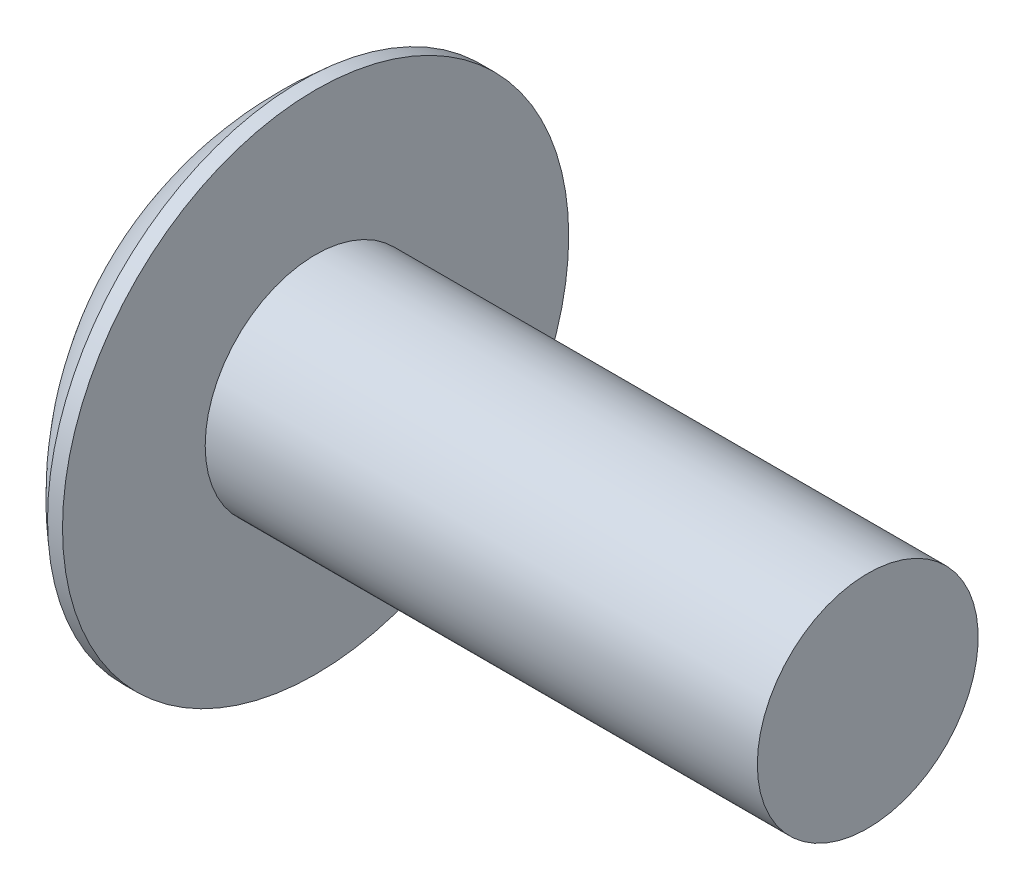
ISO-10303-21;
HEADER;
FILE_DESCRIPTION(('STEP AP214'),'2;1');
FILE_NAME('part.step','',(''),(''),'','','');
FILE_SCHEMA(('AUTOMOTIVE_DESIGN { 1 0 10303 214 1 1 1 1 }'));
ENDSEC;
DATA;
#1=APPLICATION_CONTEXT('core data for automotive mechanical design processes');
#2=APPLICATION_PROTOCOL_DEFINITION('international standard','automotive_design',2000,#1);
#3=PRODUCT_CONTEXT('',#1,'mechanical');
#4=PRODUCT('Part','Part','',(#3));
#5=PRODUCT_RELATED_PRODUCT_CATEGORY('part','',(#4));
#6=PRODUCT_DEFINITION_FORMATION('','',#4);
#7=PRODUCT_DEFINITION_CONTEXT('part definition',#1,'design');
#8=PRODUCT_DEFINITION('design','',#6,#7);
#9=PRODUCT_DEFINITION_SHAPE('','',#8);
#10=(LENGTH_UNIT() NAMED_UNIT(*) SI_UNIT(.MILLI.,.METRE.));
#11=(NAMED_UNIT(*) PLANE_ANGLE_UNIT() SI_UNIT($,.RADIAN.));
#12=(NAMED_UNIT(*) SI_UNIT($,.STERADIAN.) SOLID_ANGLE_UNIT());
#13=UNCERTAINTY_MEASURE_WITH_UNIT(LENGTH_MEASURE(1.E-05),#10,'distance_accuracy_value','');
#14=(GEOMETRIC_REPRESENTATION_CONTEXT(3) GLOBAL_UNCERTAINTY_ASSIGNED_CONTEXT((#13)) GLOBAL_UNIT_ASSIGNED_CONTEXT((#10,
#11,#12)) REPRESENTATION_CONTEXT('',''));
#15=CARTESIAN_POINT('',(0.,0.,0.));
#16=DIRECTION('',(0.,0.,1.));
#17=DIRECTION('',(1.,0.,0.));
#18=AXIS2_PLACEMENT_3D('',#15,#16,#17);
#19=CARTESIAN_POINT('',(9.525,0.,0.));
#20=DIRECTION('',(-1.,0.,0.));
#21=DIRECTION('',(0.,1.,0.));
#22=AXIS2_PLACEMENT_3D('',#19,#20,#21);
#23=SPHERICAL_SURFACE('',#22,9.525);
#24=CARTESIAN_POINT('',(3.37931528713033,0.,0.));
#25=DIRECTION('',(-1.,0.,0.));
#26=DIRECTION('',(0.,0.,1.));
#27=AXIS2_PLACEMENT_3D('',#24,#25,#26);
#28=CIRCLE('',#27,7.2771);
#29=CARTESIAN_POINT('',(3.37931528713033,0.,7.2771));
#30=VERTEX_POINT('',#29);
#31=EDGE_CURVE('E152',#30,#30,#28,.T.);
#32=ORIENTED_EDGE('',*,*,#31,.T.);
#33=EDGE_LOOP('',(#32));
#34=FACE_BOUND('',#33,.T.);
#35=CARTESIAN_POINT('',(9.52329760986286,-0.0217428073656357,0.));
#36=DIRECTION('',(-0.0780578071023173,-0.996948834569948,0.));
#37=DIRECTION('',(0.996948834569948,-0.0780578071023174,0.));
#38=AXIS2_PLACEMENT_3D('',#35,#36,#37);
#39=CIRCLE('',#38,9.5249750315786);
#40=CARTESIAN_POINT('',(0.697961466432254,0.669251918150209,3.51583810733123));
#41=VERTEX_POINT('',#40);
#42=CARTESIAN_POINT('',(0.0545254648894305,0.719630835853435,0.719630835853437));
#43=VERTEX_POINT('',#42);
#44=EDGE_CURVE('E180',#41,#43,#39,.T.);
#45=ORIENTED_EDGE('',*,*,#44,.F.);
#46=CARTESIAN_POINT('',(7.77827630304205,0.,-2.17370060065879));
#47=DIRECTION('',(0.626391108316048,0.,0.779508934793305));
#48=DIRECTION('',(0.779508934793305,0.,-0.626391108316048));
#49=AXIS2_PLACEMENT_3D('',#46,#47,#48);
#50=CIRCLE('',#49,9.10766748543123);
#51=CARTESIAN_POINT('',(0.697961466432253,-0.669251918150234,3.51583810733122));
#52=VERTEX_POINT('',#51);
#53=EDGE_CURVE('E148',#41,#52,#50,.T.);
#54=ORIENTED_EDGE('',*,*,#53,.T.);
#55=CARTESIAN_POINT('',(9.52329760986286,0.0217428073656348,0.));
#56=DIRECTION('',(-0.0780578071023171,0.996948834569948,0.));
#57=DIRECTION('',(-0.996948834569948,-0.0780578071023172,0.));
#58=AXIS2_PLACEMENT_3D('',#55,#56,#57);
#59=CIRCLE('',#58,9.5249750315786);
#60=CARTESIAN_POINT('',(0.0545254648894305,-0.719630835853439,0.719630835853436));
#61=VERTEX_POINT('',#60);
#62=EDGE_CURVE('E104',#61,#52,#59,.T.);
#63=ORIENTED_EDGE('',*,*,#62,.F.);
#64=CARTESIAN_POINT('',(9.52329760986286,0.,-0.0217428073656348));
#65=DIRECTION('',(-0.0780578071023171,0.,-0.996948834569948));
#66=DIRECTION('',(-0.996948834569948,0.,0.0780578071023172));
#67=AXIS2_PLACEMENT_3D('',#64,#65,#66);
#68=CIRCLE('',#67,9.5249750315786);
#69=CARTESIAN_POINT('',(0.697961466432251,-3.51583810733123,0.669251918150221));
#70=VERTEX_POINT('',#69);
#71=EDGE_CURVE('E129',#70,#61,#68,.T.);
#72=ORIENTED_EDGE('',*,*,#71,.F.);
#73=CARTESIAN_POINT('',(7.77827630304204,2.17370060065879,0.));
#74=DIRECTION('',(0.626391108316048,-0.779508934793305,0.));
#75=DIRECTION('',(0.779508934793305,0.626391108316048,0.));
#76=AXIS2_PLACEMENT_3D('',#73,#74,#75);
#77=CIRCLE('',#76,9.10766748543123);
#78=CARTESIAN_POINT('',(0.697961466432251,-3.51583810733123,-0.669251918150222));
#79=VERTEX_POINT('',#78);
#80=EDGE_CURVE('E137',#70,#79,#77,.T.);
#81=ORIENTED_EDGE('',*,*,#80,.T.);
#82=CARTESIAN_POINT('',(9.52329760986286,0.,0.0217428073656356));
#83=DIRECTION('',(-0.0780578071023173,0.,0.996948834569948));
#84=DIRECTION('',(0.996948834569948,0.,0.0780578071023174));
#85=AXIS2_PLACEMENT_3D('',#82,#83,#84);
#86=CIRCLE('',#85,9.5249750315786);
#87=CARTESIAN_POINT('',(0.0545254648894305,-0.719630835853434,-0.719630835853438));
#88=VERTEX_POINT('',#87);
#89=EDGE_CURVE('E47',#88,#79,#86,.T.);
#90=ORIENTED_EDGE('',*,*,#89,.F.);
#91=CARTESIAN_POINT('',(0.697961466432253,-0.669251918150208,-3.51583810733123));
#92=VERTEX_POINT('',#91);
#93=EDGE_CURVE('E187',#92,#88,#59,.T.);
#94=ORIENTED_EDGE('',*,*,#93,.F.);
#95=CARTESIAN_POINT('',(7.77827630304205,0.,2.17370060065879));
#96=DIRECTION('',(0.626391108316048,0.,-0.779508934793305));
#97=DIRECTION('',(-0.779508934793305,0.,-0.626391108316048));
#98=AXIS2_PLACEMENT_3D('',#95,#96,#97);
#99=CIRCLE('',#98,9.10766748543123);
#100=CARTESIAN_POINT('',(0.697961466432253,0.669251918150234,-3.51583810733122));
#101=VERTEX_POINT('',#100);
#102=EDGE_CURVE('E130',#92,#101,#99,.T.);
#103=ORIENTED_EDGE('',*,*,#102,.T.);
#104=CARTESIAN_POINT('',(0.0545254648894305,0.71963083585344,-0.719630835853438));
#105=VERTEX_POINT('',#104);
#106=EDGE_CURVE('E175',#105,#101,#39,.T.);
#107=ORIENTED_EDGE('',*,*,#106,.F.);
#108=CARTESIAN_POINT('',(0.697961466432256,3.51583810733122,-0.669251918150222));
#109=VERTEX_POINT('',#108);
#110=EDGE_CURVE('E40',#109,#105,#86,.T.);
#111=ORIENTED_EDGE('',*,*,#110,.F.);
#112=CARTESIAN_POINT('',(7.77827630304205,-2.17370060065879,0.));
#113=DIRECTION('',(0.626391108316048,0.779508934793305,0.));
#114=DIRECTION('',(-0.779508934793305,0.626391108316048,0.));
#115=AXIS2_PLACEMENT_3D('',#112,#113,#114);
#116=CIRCLE('',#115,9.10766748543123);
#117=CARTESIAN_POINT('',(0.697961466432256,3.51583810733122,0.669251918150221));
#118=VERTEX_POINT('',#117);
#119=EDGE_CURVE('E11',#109,#118,#116,.T.);
#120=ORIENTED_EDGE('',*,*,#119,.T.);
#121=EDGE_CURVE('E163',#43,#118,#68,.T.);
#122=ORIENTED_EDGE('',*,*,#121,.F.);
#123=EDGE_LOOP('',(#45,#54,#63,#72,#81,#90,#94,#103,#107,#111,#120,#122));
#124=FACE_BOUND('',#123,.T.);
#125=ADVANCED_FACE('F32',(#34,#124),#23,.T.);
#126=CARTESIAN_POINT('',(5.07322666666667,0.,-0.326683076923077));
#127=DIRECTION('',(-0.0780578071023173,0.,0.996948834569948));
#128=DIRECTION('',(0.996948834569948,0.,0.0780578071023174));
#129=AXIS2_PLACEMENT_3D('',#126,#127,#128);
#130=PLANE('',#129);
#131=ORIENTED_EDGE('',*,*,#110,.T.);
#132=DIRECTION('',(0.993925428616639,-0.0778210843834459,0.0778210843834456));
#133=VECTOR('',#132,1.);
#134=CARTESIAN_POINT('',(5.09849506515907,0.324704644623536,-0.324704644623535));
#135=LINE('',#134,#133);
#136=CARTESIAN_POINT('',(4.6228,0.361950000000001,-0.361949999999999));
#137=VERTEX_POINT('',#136);
#138=EDGE_CURVE('E169',#105,#137,#135,.T.);
#139=ORIENTED_EDGE('',*,*,#138,.T.);
#140=DIRECTION('',(0.778061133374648,-0.62522769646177,0.0609196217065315));
#141=VECTOR('',#140,1.);
#142=CARTESIAN_POINT('',(0.,4.0767,-0.7239));
#143=LINE('',#142,#141);
#144=EDGE_CURVE('E153',#109,#137,#143,.T.);
#145=ORIENTED_EDGE('',*,*,#144,.F.);
#146=EDGE_LOOP('',(#131,#139,#145));
#147=FACE_BOUND('',#146,.T.);
#148=ADVANCED_FACE('F168',(#147),#130,.T.);
#149=DIRECTION('',(0.778061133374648,0.625227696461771,0.0609196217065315));
#150=VECTOR('',#149,1.);
#151=CARTESIAN_POINT('',(0.,-4.0767,-0.7239));
#152=LINE('',#151,#150);
#153=CARTESIAN_POINT('',(4.6228,-0.36195,-0.36195));
#154=VERTEX_POINT('',#153);
#155=EDGE_CURVE('E138',#79,#154,#152,.T.);
#156=ORIENTED_EDGE('',*,*,#155,.T.);
#157=DIRECTION('',(-0.993925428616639,-0.0778210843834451,-0.0778210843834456));
#158=VECTOR('',#157,1.);
#159=CARTESIAN_POINT('',(5.09849506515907,-0.324704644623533,-0.324704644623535));
#160=LINE('',#159,#158);
#161=EDGE_CURVE('E190',#154,#88,#160,.T.);
#162=ORIENTED_EDGE('',*,*,#161,.T.);
#163=ORIENTED_EDGE('',*,*,#89,.T.);
#164=EDGE_LOOP('',(#156,#162,#163));
#165=FACE_BOUND('',#164,.T.);
#166=ADVANCED_FACE('F205',(#165),#130,.T.);
#167=CARTESIAN_POINT('',(5.07322666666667,0.,0.326683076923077));
#168=DIRECTION('',(-0.0780578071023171,0.,-0.996948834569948));
#169=DIRECTION('',(-0.996948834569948,0.,0.0780578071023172));
#170=AXIS2_PLACEMENT_3D('',#167,#168,#169);
#171=PLANE('',#170);
#172=DIRECTION('',(0.778061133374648,-0.62522769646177,-0.0609196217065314));
#173=VECTOR('',#172,1.);
#174=CARTESIAN_POINT('',(0.,4.0767,0.7239));
#175=LINE('',#174,#173);
#176=CARTESIAN_POINT('',(4.6228,0.36195,0.36195));
#177=VERTEX_POINT('',#176);
#178=EDGE_CURVE('E206',#118,#177,#175,.T.);
#179=ORIENTED_EDGE('',*,*,#178,.T.);
#180=DIRECTION('',(-0.993925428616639,0.0778210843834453,0.0778210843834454));
#181=VECTOR('',#180,1.);
#182=CARTESIAN_POINT('',(5.09849506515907,0.324704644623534,0.324704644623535));
#183=LINE('',#182,#181);
#184=EDGE_CURVE('E184',#177,#43,#183,.T.);
#185=ORIENTED_EDGE('',*,*,#184,.T.);
#186=ORIENTED_EDGE('',*,*,#121,.T.);
#187=EDGE_LOOP('',(#179,#185,#186));
#188=FACE_BOUND('',#187,.T.);
#189=ADVANCED_FACE('F210',(#188),#171,.T.);
#190=ORIENTED_EDGE('',*,*,#71,.T.);
#191=DIRECTION('',(0.993925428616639,0.0778210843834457,-0.0778210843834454));
#192=VECTOR('',#191,1.);
#193=CARTESIAN_POINT('',(5.09849506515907,-0.324704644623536,0.324704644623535));
#194=LINE('',#193,#192);
#195=CARTESIAN_POINT('',(4.6228,-0.361950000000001,0.361949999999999));
#196=VERTEX_POINT('',#195);
#197=EDGE_CURVE('E102',#61,#196,#194,.T.);
#198=ORIENTED_EDGE('',*,*,#197,.T.);
#199=DIRECTION('',(0.778061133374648,0.62522769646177,-0.0609196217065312));
#200=VECTOR('',#199,1.);
#201=CARTESIAN_POINT('',(0.,-4.0767,0.723899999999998));
#202=LINE('',#201,#200);
#203=EDGE_CURVE('E127',#70,#196,#202,.T.);
#204=ORIENTED_EDGE('',*,*,#203,.F.);
#205=EDGE_LOOP('',(#190,#198,#204));
#206=FACE_BOUND('',#205,.T.);
#207=ADVANCED_FACE('F126',(#206),#171,.T.);
#208=CARTESIAN_POINT('',(-25.4,0.,0.));
#209=DIRECTION('',(-1.,0.,0.));
#210=DIRECTION('',(0.,0.,1.));
#211=AXIS2_PLACEMENT_3D('',#208,#209,#210);
#212=CYLINDRICAL_SURFACE('',#211,3.175);
#213=CARTESIAN_POINT('',(19.685,0.,0.));
#214=DIRECTION('',(-1.,0.,0.));
#215=DIRECTION('',(0.,0.,1.));
#216=AXIS2_PLACEMENT_3D('',#213,#214,#215);
#217=CIRCLE('',#216,3.175);
#218=CARTESIAN_POINT('',(19.685,0.,3.175));
#219=VERTEX_POINT('',#218);
#220=EDGE_CURVE('E149',#219,#219,#217,.T.);
#221=ORIENTED_EDGE('',*,*,#220,.T.);
#222=EDGE_LOOP('',(#221));
#223=FACE_BOUND('',#222,.T.);
#224=CARTESIAN_POINT('',(3.81,0.,0.));
#225=DIRECTION('',(-1.,0.,0.));
#226=DIRECTION('',(0.,0.,1.));
#227=AXIS2_PLACEMENT_3D('',#224,#225,#226);
#228=CIRCLE('',#227,3.175);
#229=CARTESIAN_POINT('',(3.81,0.,3.175));
#230=VERTEX_POINT('',#229);
#231=EDGE_CURVE('E159',#230,#230,#228,.T.);
#232=ORIENTED_EDGE('',*,*,#231,.F.);
#233=EDGE_LOOP('',(#232));
#234=FACE_BOUND('',#233,.T.);
#235=ADVANCED_FACE('F34',(#223,#234),#212,.T.);
#236=CARTESIAN_POINT('',(3.81,3.175,0.));
#237=DIRECTION('',(-1.,0.,0.));
#238=DIRECTION('',(0.,0.,1.));
#239=AXIS2_PLACEMENT_3D('',#236,#237,#238);
#240=PLANE('',#239);
#241=CARTESIAN_POINT('',(3.81,0.,0.));
#242=DIRECTION('',(-1.,0.,0.));
#243=DIRECTION('',(0.,0.,1.));
#244=AXIS2_PLACEMENT_3D('',#241,#242,#243);
#245=CIRCLE('',#244,7.2771);
#246=CARTESIAN_POINT('',(3.81,0.,7.2771));
#247=VERTEX_POINT('',#246);
#248=EDGE_CURVE('E156',#247,#247,#245,.T.);
#249=ORIENTED_EDGE('',*,*,#248,.F.);
#250=EDGE_LOOP('',(#249));
#251=FACE_BOUND('',#250,.T.);
#252=ORIENTED_EDGE('',*,*,#231,.T.);
#253=EDGE_LOOP('',(#252));
#254=FACE_BOUND('',#253,.T.);
#255=ADVANCED_FACE('F234',(#251,#254),#240,.F.);
#256=CARTESIAN_POINT('',(-25.4,0.,0.));
#257=DIRECTION('',(-1.,0.,0.));
#258=DIRECTION('',(0.,0.,1.));
#259=AXIS2_PLACEMENT_3D('',#256,#257,#258);
#260=CYLINDRICAL_SURFACE('',#259,7.2771);
#261=ORIENTED_EDGE('',*,*,#248,.T.);
#262=EDGE_LOOP('',(#261));
#263=FACE_BOUND('',#262,.T.);
#264=ORIENTED_EDGE('',*,*,#31,.F.);
#265=EDGE_LOOP('',(#264));
#266=FACE_BOUND('',#265,.T.);
#267=ADVANCED_FACE('F232',(#263,#266),#260,.T.);
#268=CARTESIAN_POINT('',(19.685,3.175,0.));
#269=DIRECTION('',(1.,0.,0.));
#270=DIRECTION('',(0.,0.,-1.));
#271=AXIS2_PLACEMENT_3D('',#268,#269,#270);
#272=PLANE('',#271);
#273=ORIENTED_EDGE('',*,*,#220,.F.);
#274=EDGE_LOOP('',(#273));
#275=FACE_BOUND('',#274,.T.);
#276=ADVANCED_FACE('F230',(#275),#272,.T.);
#277=CARTESIAN_POINT('',(4.6228,0.36195,0.36195));
#278=DIRECTION('',(0.626391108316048,0.779508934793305,0.));
#279=DIRECTION('',(-0.779508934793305,0.626391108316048,0.));
#280=AXIS2_PLACEMENT_3D('',#277,#278,#279);
#281=PLANE('',#280);
#282=ORIENTED_EDGE('',*,*,#144,.T.);
#283=DIRECTION('',(0.,0.,-1.));
#284=VECTOR('',#283,1.);
#285=CARTESIAN_POINT('',(4.6228,0.36195,0.36195));
#286=LINE('',#285,#284);
#287=EDGE_CURVE('E120',#177,#137,#286,.T.);
#288=ORIENTED_EDGE('',*,*,#287,.F.);
#289=ORIENTED_EDGE('',*,*,#178,.F.);
#290=ORIENTED_EDGE('',*,*,#119,.F.);
#291=EDGE_LOOP('',(#282,#288,#289,#290));
#292=FACE_BOUND('',#291,.T.);
#293=ADVANCED_FACE('F209',(#292),#281,.F.);
#294=CARTESIAN_POINT('',(4.6228,-0.36195,-0.36195));
#295=DIRECTION('',(0.626391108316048,-0.779508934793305,0.));
#296=DIRECTION('',(0.779508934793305,0.626391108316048,0.));
#297=AXIS2_PLACEMENT_3D('',#294,#295,#296);
#298=PLANE('',#297);
#299=ORIENTED_EDGE('',*,*,#203,.T.);
#300=DIRECTION('',(0.,0.,1.));
#301=VECTOR('',#300,1.);
#302=CARTESIAN_POINT('',(4.6228,-0.36195,-0.36195));
#303=LINE('',#302,#301);
#304=EDGE_CURVE('E119',#154,#196,#303,.T.);
#305=ORIENTED_EDGE('',*,*,#304,.F.);
#306=ORIENTED_EDGE('',*,*,#155,.F.);
#307=ORIENTED_EDGE('',*,*,#80,.F.);
#308=EDGE_LOOP('',(#299,#305,#306,#307));
#309=FACE_BOUND('',#308,.T.);
#310=ADVANCED_FACE('F134',(#309),#298,.F.);
#311=CARTESIAN_POINT('',(4.6228,0.36195,-0.36195));
#312=DIRECTION('',(-1.,0.,0.));
#313=DIRECTION('',(0.,0.,1.));
#314=AXIS2_PLACEMENT_3D('',#311,#312,#313);
#315=PLANE('',#314);
#316=DIRECTION('',(0.,1.,0.));
#317=VECTOR('',#316,1.);
#318=CARTESIAN_POINT('',(4.6228,-0.36195,-0.36195));
#319=LINE('',#318,#317);
#320=EDGE_CURVE('E142',#154,#137,#319,.T.);
#321=ORIENTED_EDGE('',*,*,#320,.F.);
#322=ORIENTED_EDGE('',*,*,#304,.T.);
#323=DIRECTION('',(0.,-1.,0.));
#324=VECTOR('',#323,1.);
#325=CARTESIAN_POINT('',(4.6228,0.36195,0.36195));
#326=LINE('',#325,#324);
#327=EDGE_CURVE('E111',#177,#196,#326,.T.);
#328=ORIENTED_EDGE('',*,*,#327,.F.);
#329=ORIENTED_EDGE('',*,*,#287,.T.);
#330=EDGE_LOOP('',(#321,#322,#328,#329));
#331=FACE_BOUND('',#330,.T.);
#332=ADVANCED_FACE('F140',(#331),#315,.T.);
#333=CARTESIAN_POINT('',(4.6228,0.361950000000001,-0.361949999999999));
#334=DIRECTION('',(0.626391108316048,0.,-0.779508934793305));
#335=DIRECTION('',(0.779508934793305,0.,0.626391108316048));
#336=AXIS2_PLACEMENT_3D('',#333,#334,#335);
#337=PLANE('',#336);
#338=DIRECTION('',(0.778061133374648,0.0609196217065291,0.625227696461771));
#339=VECTOR('',#338,1.);
#340=CARTESIAN_POINT('',(0.,-0.723899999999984,-4.0767));
#341=LINE('',#340,#339);
#342=EDGE_CURVE('E195',#92,#154,#341,.T.);
#343=ORIENTED_EDGE('',*,*,#342,.T.);
#344=ORIENTED_EDGE('',*,*,#320,.T.);
#345=DIRECTION('',(0.778061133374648,-0.0609196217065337,0.62522769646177));
#346=VECTOR('',#345,1.);
#347=CARTESIAN_POINT('',(0.,0.723900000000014,-4.0767));
#348=LINE('',#347,#346);
#349=EDGE_CURVE('E108',#101,#137,#348,.T.);
#350=ORIENTED_EDGE('',*,*,#349,.F.);
#351=ORIENTED_EDGE('',*,*,#102,.F.);
#352=EDGE_LOOP('',(#343,#344,#350,#351));
#353=FACE_BOUND('',#352,.T.);
#354=ADVANCED_FACE('F200',(#353),#337,.F.);
#355=CARTESIAN_POINT('',(5.07322666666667,-0.326683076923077,0.));
#356=DIRECTION('',(-0.0780578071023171,0.996948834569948,0.));
#357=DIRECTION('',(-0.996948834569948,-0.0780578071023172,0.));
#358=AXIS2_PLACEMENT_3D('',#355,#356,#357);
#359=PLANE('',#358);
#360=ORIENTED_EDGE('',*,*,#93,.T.);
#361=ORIENTED_EDGE('',*,*,#161,.F.);
#362=ORIENTED_EDGE('',*,*,#342,.F.);
#363=EDGE_LOOP('',(#360,#361,#362));
#364=FACE_BOUND('',#363,.T.);
#365=ADVANCED_FACE('F204',(#364),#359,.T.);
#366=CARTESIAN_POINT('',(5.07322666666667,0.326683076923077,0.));
#367=DIRECTION('',(-0.0780578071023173,-0.996948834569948,0.));
#368=DIRECTION('',(0.996948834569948,-0.0780578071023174,0.));
#369=AXIS2_PLACEMENT_3D('',#366,#367,#368);
#370=PLANE('',#369);
#371=ORIENTED_EDGE('',*,*,#106,.T.);
#372=ORIENTED_EDGE('',*,*,#349,.T.);
#373=ORIENTED_EDGE('',*,*,#138,.F.);
#374=EDGE_LOOP('',(#371,#372,#373));
#375=FACE_BOUND('',#374,.T.);
#376=ADVANCED_FACE('F198',(#375),#370,.T.);
#377=CARTESIAN_POINT('',(4.6228,-0.361950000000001,0.361949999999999));
#378=DIRECTION('',(0.626391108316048,0.,0.779508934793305));
#379=DIRECTION('',(-0.779508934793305,0.,0.626391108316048));
#380=AXIS2_PLACEMENT_3D('',#377,#378,#379);
#381=PLANE('',#380);
#382=DIRECTION('',(0.778061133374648,-0.0609196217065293,-0.625227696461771));
#383=VECTOR('',#382,1.);
#384=CARTESIAN_POINT('',(0.,0.723899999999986,4.0767));
#385=LINE('',#384,#383);
#386=EDGE_CURVE('E107',#41,#177,#385,.T.);
#387=ORIENTED_EDGE('',*,*,#386,.T.);
#388=ORIENTED_EDGE('',*,*,#327,.T.);
#389=DIRECTION('',(0.778061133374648,0.0609196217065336,-0.62522769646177));
#390=VECTOR('',#389,1.);
#391=CARTESIAN_POINT('',(0.,-0.723900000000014,4.0767));
#392=LINE('',#391,#390);
#393=EDGE_CURVE('E98',#52,#196,#392,.T.);
#394=ORIENTED_EDGE('',*,*,#393,.F.);
#395=ORIENTED_EDGE('',*,*,#53,.F.);
#396=EDGE_LOOP('',(#387,#388,#394,#395));
#397=FACE_BOUND('',#396,.T.);
#398=ADVANCED_FACE('F112',(#397),#381,.F.);
#399=ORIENTED_EDGE('',*,*,#44,.T.);
#400=ORIENTED_EDGE('',*,*,#184,.F.);
#401=ORIENTED_EDGE('',*,*,#386,.F.);
#402=EDGE_LOOP('',(#399,#400,#401));
#403=FACE_BOUND('',#402,.T.);
#404=ADVANCED_FACE('F211',(#403),#370,.T.);
#405=ORIENTED_EDGE('',*,*,#62,.T.);
#406=ORIENTED_EDGE('',*,*,#393,.T.);
#407=ORIENTED_EDGE('',*,*,#197,.F.);
#408=EDGE_LOOP('',(#405,#406,#407));
#409=FACE_BOUND('',#408,.T.);
#410=ADVANCED_FACE('F100',(#409),#359,.T.);
#411=CLOSED_SHELL('',(#125,#148,#166,#189,#207,#235,#255,#267,#276,#293,#310,#332,#354,#365,
#376,#398,#404,#410));
#412=MANIFOLD_SOLID_BREP('B2',#411);
#413=ADVANCED_BREP_SHAPE_REPRESENTATION('',(#18,#412),#14);
#414=SHAPE_DEFINITION_REPRESENTATION(#9,#413);
ENDSEC;
END-ISO-10303-21;
